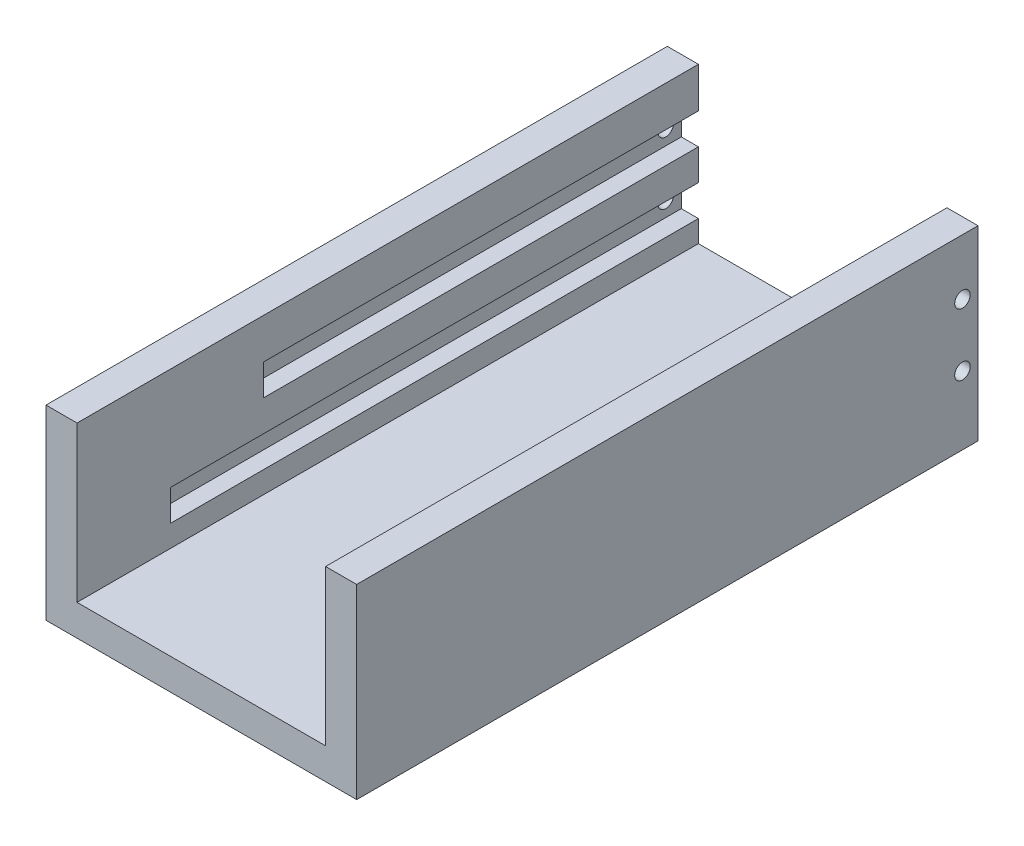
from build123d import *

# Parameters (mm, degrees)
EXTRUDE_THIN1_DEPTH = 200
SKETCH4_W           = 170
SKETCH4_H           = 10
SKETCH4_W_2         = 140
CUT_EXTRUDE2_DEPTH  = 5.5
SKETCH5_R           = 2.5
CUT_EXTRUDE3_DEPTH  = 232.516738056


with BuildPart() as part:
    # Sketch1 → Extrude-Thin1 (new body)
    with BuildSketch(Plane.XY):
        Polygon((50, 60), (50, 0), (-50, 0), (-50, 60), (-40, 60), (-40, 10), (40, 10), (40, 60), align=None)
    extrude(amount=EXTRUDE_THIN1_DEPTH)

    # Sketch4 → Cut-Extrude2 (cut)
    with BuildSketch(Plane(origin=(-40, 0, 0), x_dir=(0, 0, -1), z_dir=(1, 0, 0))):
        with Locations((-85, 22)):
            Rectangle(SKETCH4_W, SKETCH4_H)
        with Locations((-70, 42)):
            Rectangle(SKETCH4_W_2, SKETCH4_H)
    cut_extrude2 = extrude(amount=-CUT_EXTRUDE2_DEPTH, mode=Mode.SUBTRACT)

    # Mirror1: Cut-Extrude2 across plane
    add(cut_extrude2.mirror(Plane(origin=(0, 0, 0), x_dir=(0, 0, 1), z_dir=(1, 0, 0))), mode=Mode.SUBTRACT)

    # Sketch5 → Cut-Extrude3 (cut, through all)
    with BuildSketch(Plane(origin=(50, 0, 0), x_dir=(0, 0, -1), z_dir=(1, 0, 0))):
        with Locations((-5, 42)):
            Circle(SKETCH5_R)
        with Locations((-5, 22)):
            Circle(SKETCH5_R)
    extrude(amount=-CUT_EXTRUDE3_DEPTH, mode=Mode.SUBTRACT)


solid = part.part
